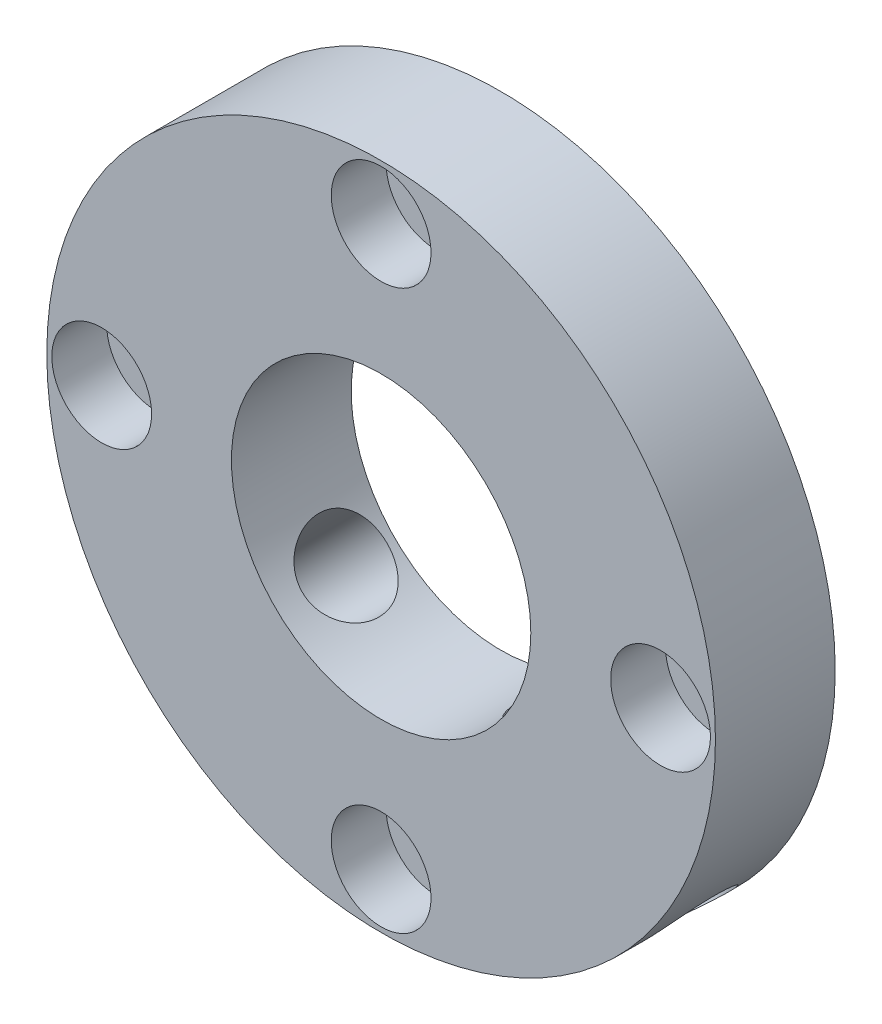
ISO-10303-21;
HEADER;
FILE_DESCRIPTION(('STEP AP214'),'2;1');
FILE_NAME('part.step','',(''),(''),'','','');
FILE_SCHEMA(('AUTOMOTIVE_DESIGN { 1 0 10303 214 1 1 1 1 }'));
ENDSEC;
DATA;
#1=APPLICATION_CONTEXT('core data for automotive mechanical design processes');
#2=APPLICATION_PROTOCOL_DEFINITION('international standard','automotive_design',2000,#1);
#3=PRODUCT_CONTEXT('',#1,'mechanical');
#4=PRODUCT('Part','Part','',(#3));
#5=PRODUCT_RELATED_PRODUCT_CATEGORY('part','',(#4));
#6=PRODUCT_DEFINITION_FORMATION('','',#4);
#7=PRODUCT_DEFINITION_CONTEXT('part definition',#1,'design');
#8=PRODUCT_DEFINITION('design','',#6,#7);
#9=PRODUCT_DEFINITION_SHAPE('','',#8);
#10=(LENGTH_UNIT() NAMED_UNIT(*) SI_UNIT(.MILLI.,.METRE.));
#11=(NAMED_UNIT(*) PLANE_ANGLE_UNIT() SI_UNIT($,.RADIAN.));
#12=(NAMED_UNIT(*) SI_UNIT($,.STERADIAN.) SOLID_ANGLE_UNIT());
#13=UNCERTAINTY_MEASURE_WITH_UNIT(LENGTH_MEASURE(1.E-05),#10,'distance_accuracy_value','');
#14=(GEOMETRIC_REPRESENTATION_CONTEXT(3) GLOBAL_UNCERTAINTY_ASSIGNED_CONTEXT((#13)) GLOBAL_UNIT_ASSIGNED_CONTEXT((#10,
#11,#12)) REPRESENTATION_CONTEXT('',''));
#15=CARTESIAN_POINT('',(0.,0.,0.));
#16=DIRECTION('',(0.,0.,1.));
#17=DIRECTION('',(1.,0.,0.));
#18=AXIS2_PLACEMENT_3D('',#15,#16,#17);
#19=CARTESIAN_POINT('',(0.,0.,12.));
#20=DIRECTION('',(0.,0.,1.));
#21=DIRECTION('',(1.,0.,0.));
#22=AXIS2_PLACEMENT_3D('',#19,#20,#21);
#23=PLANE('',#22);
#24=CARTESIAN_POINT('',(-28.,2.91935493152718E-13,12.));
#25=DIRECTION('',(0.,0.,1.));
#26=DIRECTION('',(1.,0.,0.));
#27=AXIS2_PLACEMENT_3D('',#24,#25,#26);
#28=CIRCLE('',#27,5.);
#29=CARTESIAN_POINT('',(-23.,2.91935493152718E-13,12.));
#30=VERTEX_POINT('',#29);
#31=EDGE_CURVE('E124',#30,#30,#28,.T.);
#32=ORIENTED_EDGE('',*,*,#31,.F.);
#33=EDGE_LOOP('',(#32));
#34=FACE_BOUND('',#33,.T.);
#35=CARTESIAN_POINT('',(0.,-28.,12.));
#36=DIRECTION('',(0.,0.,1.));
#37=DIRECTION('',(1.,0.,0.));
#38=AXIS2_PLACEMENT_3D('',#35,#36,#37);
#39=CIRCLE('',#38,5.);
#40=CARTESIAN_POINT('',(5.,-28.,12.));
#41=VERTEX_POINT('',#40);
#42=EDGE_CURVE('E108',#41,#41,#39,.T.);
#43=ORIENTED_EDGE('',*,*,#42,.F.);
#44=EDGE_LOOP('',(#43));
#45=FACE_BOUND('',#44,.T.);
#46=CARTESIAN_POINT('',(28.,0.,12.));
#47=DIRECTION('',(0.,0.,1.));
#48=DIRECTION('',(1.,0.,0.));
#49=AXIS2_PLACEMENT_3D('',#46,#47,#48);
#50=CIRCLE('',#49,5.);
#51=CARTESIAN_POINT('',(33.,0.,12.));
#52=VERTEX_POINT('',#51);
#53=EDGE_CURVE('E92',#52,#52,#50,.T.);
#54=ORIENTED_EDGE('',*,*,#53,.F.);
#55=EDGE_LOOP('',(#54));
#56=FACE_BOUND('',#55,.T.);
#57=CARTESIAN_POINT('',(0.,28.,12.));
#58=DIRECTION('',(0.,0.,1.));
#59=DIRECTION('',(1.,0.,0.));
#60=AXIS2_PLACEMENT_3D('',#57,#58,#59);
#61=CIRCLE('',#60,5.);
#62=CARTESIAN_POINT('',(5.,28.,12.));
#63=VERTEX_POINT('',#62);
#64=EDGE_CURVE('E76',#63,#63,#61,.T.);
#65=ORIENTED_EDGE('',*,*,#64,.F.);
#66=EDGE_LOOP('',(#65));
#67=FACE_BOUND('',#66,.T.);
#68=CARTESIAN_POINT('',(0.,0.,12.));
#69=DIRECTION('',(0.,0.,1.));
#70=DIRECTION('',(1.,0.,0.));
#71=AXIS2_PLACEMENT_3D('',#68,#69,#70);
#72=CIRCLE('',#71,33.5);
#73=CARTESIAN_POINT('',(33.5,0.,12.));
#74=VERTEX_POINT('',#73);
#75=EDGE_CURVE('E10',#74,#74,#72,.T.);
#76=ORIENTED_EDGE('',*,*,#75,.T.);
#77=EDGE_LOOP('',(#76));
#78=FACE_BOUND('',#77,.T.);
#79=CARTESIAN_POINT('',(0.,0.,12.));
#80=DIRECTION('',(0.,0.,1.));
#81=DIRECTION('',(1.,0.,0.));
#82=AXIS2_PLACEMENT_3D('',#79,#80,#81);
#83=CIRCLE('',#82,15.);
#84=CARTESIAN_POINT('',(15.,0.,12.));
#85=VERTEX_POINT('',#84);
#86=EDGE_CURVE('E55',#85,#85,#83,.T.);
#87=ORIENTED_EDGE('',*,*,#86,.F.);
#88=EDGE_LOOP('',(#87));
#89=FACE_BOUND('',#88,.T.);
#90=ADVANCED_FACE('F41',(#34,#45,#56,#67,#78,#89),#23,.T.);
#91=CARTESIAN_POINT('',(0.,0.,0.));
#92=DIRECTION('',(0.,0.,1.));
#93=DIRECTION('',(1.,0.,0.));
#94=AXIS2_PLACEMENT_3D('',#91,#92,#93);
#95=PLANE('',#94);
#96=CARTESIAN_POINT('',(-28.,2.91935493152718E-13,0.));
#97=DIRECTION('',(0.,0.,1.));
#98=DIRECTION('',(1.,0.,0.));
#99=AXIS2_PLACEMENT_3D('',#96,#97,#98);
#100=CIRCLE('',#99,2.75);
#101=CARTESIAN_POINT('',(-25.25,2.91935493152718E-13,0.));
#102=VERTEX_POINT('',#101);
#103=EDGE_CURVE('E112',#102,#102,#100,.T.);
#104=ORIENTED_EDGE('',*,*,#103,.T.);
#105=EDGE_LOOP('',(#104));
#106=FACE_BOUND('',#105,.T.);
#107=CARTESIAN_POINT('',(0.,-28.,0.));
#108=DIRECTION('',(0.,0.,1.));
#109=DIRECTION('',(1.,0.,0.));
#110=AXIS2_PLACEMENT_3D('',#107,#108,#109);
#111=CIRCLE('',#110,2.75);
#112=CARTESIAN_POINT('',(2.75,-28.,0.));
#113=VERTEX_POINT('',#112);
#114=EDGE_CURVE('E96',#113,#113,#111,.T.);
#115=ORIENTED_EDGE('',*,*,#114,.T.);
#116=EDGE_LOOP('',(#115));
#117=FACE_BOUND('',#116,.T.);
#118=CARTESIAN_POINT('',(28.,0.,0.));
#119=DIRECTION('',(0.,0.,1.));
#120=DIRECTION('',(1.,0.,0.));
#121=AXIS2_PLACEMENT_3D('',#118,#119,#120);
#122=CIRCLE('',#121,2.75);
#123=CARTESIAN_POINT('',(30.75,0.,0.));
#124=VERTEX_POINT('',#123);
#125=EDGE_CURVE('E80',#124,#124,#122,.T.);
#126=ORIENTED_EDGE('',*,*,#125,.T.);
#127=EDGE_LOOP('',(#126));
#128=FACE_BOUND('',#127,.T.);
#129=CARTESIAN_POINT('',(0.,28.,0.));
#130=DIRECTION('',(0.,0.,1.));
#131=DIRECTION('',(1.,0.,0.));
#132=AXIS2_PLACEMENT_3D('',#129,#130,#131);
#133=CIRCLE('',#132,2.75);
#134=CARTESIAN_POINT('',(2.75,28.,0.));
#135=VERTEX_POINT('',#134);
#136=EDGE_CURVE('E61',#135,#135,#133,.T.);
#137=ORIENTED_EDGE('',*,*,#136,.T.);
#138=EDGE_LOOP('',(#137));
#139=FACE_BOUND('',#138,.T.);
#140=CARTESIAN_POINT('',(0.,0.,0.));
#141=DIRECTION('',(0.,0.,1.));
#142=DIRECTION('',(1.,0.,0.));
#143=AXIS2_PLACEMENT_3D('',#140,#141,#142);
#144=CIRCLE('',#143,33.5);
#145=CARTESIAN_POINT('',(33.5,0.,0.));
#146=VERTEX_POINT('',#145);
#147=EDGE_CURVE('E46',#146,#146,#144,.T.);
#148=ORIENTED_EDGE('',*,*,#147,.F.);
#149=EDGE_LOOP('',(#148));
#150=FACE_BOUND('',#149,.T.);
#151=CARTESIAN_POINT('',(0.,0.,0.));
#152=DIRECTION('',(0.,0.,1.));
#153=DIRECTION('',(1.,0.,0.));
#154=AXIS2_PLACEMENT_3D('',#151,#152,#153);
#155=CIRCLE('',#154,15.);
#156=CARTESIAN_POINT('',(15.,0.,0.));
#157=VERTEX_POINT('',#156);
#158=EDGE_CURVE('E57',#157,#157,#155,.T.);
#159=ORIENTED_EDGE('',*,*,#158,.T.);
#160=EDGE_LOOP('',(#159));
#161=FACE_BOUND('',#160,.T.);
#162=ADVANCED_FACE('F206',(#106,#117,#128,#139,#150,#161),#95,.F.);
#163=CARTESIAN_POINT('',(0.,0.,12.));
#164=DIRECTION('',(0.,0.,-1.));
#165=DIRECTION('',(-1.,0.,0.));
#166=AXIS2_PLACEMENT_3D('',#163,#164,#165);
#167=CYLINDRICAL_SURFACE('',#166,33.5);
#168=CARTESIAN_POINT('',(26.5018791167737,-20.4914714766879,5.05));
#169=CARTESIAN_POINT('',(26.5018744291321,-20.4914810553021,4.81230853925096));
#170=CARTESIAN_POINT('',(26.4895545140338,-20.5074417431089,4.57446924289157));
#171=CARTESIAN_POINT('',(26.4404524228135,-20.5707077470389,4.10541184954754));
#172=CARTESIAN_POINT('',(26.4036448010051,-20.6180456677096,3.87420090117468));
#173=CARTESIAN_POINT('',(26.3062231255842,-20.7421988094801,3.42525918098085));
#174=CARTESIAN_POINT('',(26.2456253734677,-20.818993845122,3.20751929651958));
#175=CARTESIAN_POINT('',(26.1016979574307,-20.9991570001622,2.79147309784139));
#176=CARTESIAN_POINT('',(26.0183721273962,-21.1025206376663,2.59316351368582));
#177=CARTESIAN_POINT('',(25.8299981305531,-21.3326829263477,2.22042486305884));
#178=CARTESIAN_POINT('',(25.7248403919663,-21.4595994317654,2.04612393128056));
#179=CARTESIAN_POINT('',(25.4950782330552,-21.7320656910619,1.72745742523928));
#180=CARTESIAN_POINT('',(25.3704728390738,-21.8776163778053,1.58309335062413));
#181=CARTESIAN_POINT('',(25.1039419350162,-22.1829493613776,1.32793795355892));
#182=CARTESIAN_POINT('',(24.9619588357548,-22.34277847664,1.2172627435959));
#183=CARTESIAN_POINT('',(24.6642645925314,-22.6709744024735,1.03337054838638));
#184=CARTESIAN_POINT('',(24.5085539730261,-22.839340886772,0.96015213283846));
#185=CARTESIAN_POINT('',(24.1881893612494,-23.178342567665,0.853635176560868));
#186=CARTESIAN_POINT('',(24.0235881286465,-23.3489606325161,0.820123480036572));
#187=CARTESIAN_POINT('',(23.6891474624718,-23.6882040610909,0.793310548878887));
#188=CARTESIAN_POINT('',(23.5193082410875,-23.8568295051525,0.800007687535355));
#189=CARTESIAN_POINT('',(23.1803039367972,-24.1863409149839,0.853251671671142));
#190=CARTESIAN_POINT('',(23.0111405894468,-24.3472657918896,0.899569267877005));
#191=CARTESIAN_POINT('',(22.6776247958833,-24.6582106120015,1.03038091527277));
#192=CARTESIAN_POINT('',(22.5132724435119,-24.8082303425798,1.11487571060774));
#193=CARTESIAN_POINT('',(22.1941097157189,-25.09417421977,1.31988642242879));
#194=CARTESIAN_POINT('',(22.0393270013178,-25.2300582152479,1.44050136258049));
#195=CARTESIAN_POINT('',(21.7448557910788,-25.4842921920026,1.71425649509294));
#196=CARTESIAN_POINT('',(21.605168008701,-25.6026413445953,1.86739822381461));
#197=CARTESIAN_POINT('',(21.3447015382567,-25.8202009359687,2.20314331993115));
#198=CARTESIAN_POINT('',(21.2240628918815,-25.9192707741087,2.38594650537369));
#199=CARTESIAN_POINT('',(21.0071935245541,-26.0953519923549,2.77513950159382));
#200=CARTESIAN_POINT('',(20.910962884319,-26.172363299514,2.9815293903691));
#201=CARTESIAN_POINT('',(20.7464477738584,-26.3029655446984,3.41221602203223));
#202=CARTESIAN_POINT('',(20.6781757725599,-26.3565460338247,3.63652070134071));
#203=CARTESIAN_POINT('',(20.5722842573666,-26.4392828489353,4.09657646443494));
#204=CARTESIAN_POINT('',(20.5346632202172,-26.4684403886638,4.33232697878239));
#205=CARTESIAN_POINT('',(20.4917152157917,-26.5017047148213,4.80682878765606));
#206=CARTESIAN_POINT('',(20.4861657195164,-26.5059841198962,5.04554785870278));
#207=CARTESIAN_POINT('',(20.5069846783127,-26.4898800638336,5.52074699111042));
#208=CARTESIAN_POINT('',(20.5333524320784,-26.4694971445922,5.75722710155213));
#209=CARTESIAN_POINT('',(20.6168159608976,-26.4045384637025,6.22039623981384));
#210=CARTESIAN_POINT('',(20.6738044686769,-26.3600471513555,6.44711648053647));
#211=CARTESIAN_POINT('',(20.8162571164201,-26.2476974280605,6.88530713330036));
#212=CARTESIAN_POINT('',(20.9017222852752,-26.1798381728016,7.09677699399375));
#213=CARTESIAN_POINT('',(21.0985049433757,-26.0215115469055,7.49972738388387));
#214=CARTESIAN_POINT('',(21.2099604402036,-25.9309232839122,7.69109300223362));
#215=CARTESIAN_POINT('',(21.4544709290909,-25.7289866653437,8.04722967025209));
#216=CARTESIAN_POINT('',(21.5875267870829,-25.6176374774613,8.21199965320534));
#217=CARTESIAN_POINT('',(21.8714865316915,-25.375638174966,8.51125086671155));
#218=CARTESIAN_POINT('',(22.0224907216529,-25.2448784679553,8.64554838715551));
#219=CARTESIAN_POINT('',(22.3366281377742,-24.9673568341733,8.878770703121));
#220=CARTESIAN_POINT('',(22.4997611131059,-24.8205952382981,8.97769622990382));
#221=CARTESIAN_POINT('',(22.832384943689,-24.5149551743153,9.13706373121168));
#222=CARTESIAN_POINT('',(23.0018569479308,-24.3561113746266,9.19761148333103));
#223=CARTESIAN_POINT('',(23.3422861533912,-24.0300478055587,9.2788486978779));
#224=CARTESIAN_POINT('',(23.513243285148,-23.8628284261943,9.299540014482));
#225=CARTESIAN_POINT('',(23.8503637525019,-23.5258699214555,9.30044163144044));
#226=CARTESIAN_POINT('',(24.0165523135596,-23.3561567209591,9.28093505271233));
#227=CARTESIAN_POINT('',(24.3407957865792,-23.0180482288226,9.20259473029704));
#228=CARTESIAN_POINT('',(24.4988507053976,-22.8496529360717,9.1437610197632));
#229=CARTESIAN_POINT('',(24.8027436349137,-22.5194201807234,8.98852622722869));
#230=CARTESIAN_POINT('',(24.9485861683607,-22.3575803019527,8.8921391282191));
#231=CARTESIAN_POINT('',(25.2247377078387,-22.0455453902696,8.66456298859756));
#232=CARTESIAN_POINT('',(25.3550465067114,-21.8953505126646,8.53337348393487));
#233=CARTESIAN_POINT('',(25.5981977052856,-21.6105905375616,8.23887054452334));
#234=CARTESIAN_POINT('',(25.7109164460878,-21.4761376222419,8.07534652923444));
#235=CARTESIAN_POINT('',(25.9156265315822,-21.2286637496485,7.72125450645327));
#236=CARTESIAN_POINT('',(26.0076129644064,-21.1156478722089,7.53068010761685));
#237=CARTESIAN_POINT('',(26.1694447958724,-20.9147535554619,7.12702585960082));
#238=CARTESIAN_POINT('',(26.2392006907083,-20.8269768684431,6.91385952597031));
#239=CARTESIAN_POINT('',(26.3547595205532,-20.680556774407,6.47180222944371));
#240=CARTESIAN_POINT('',(26.4005884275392,-20.6218817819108,6.24292862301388));
#241=CARTESIAN_POINT('',(26.4566263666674,-20.5498953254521,5.85240054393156));
#242=CARTESIAN_POINT('',(26.4735804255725,-20.5280268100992,5.69320617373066));
#243=CARTESIAN_POINT('',(26.4962083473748,-20.4988116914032,5.37269724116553));
#244=CARTESIAN_POINT('',(26.5018822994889,-20.4914649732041,5.21138269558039));
#245=CARTESIAN_POINT('',(26.5018791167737,-20.4914714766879,5.05));
#246=B_SPLINE_CURVE_WITH_KNOTS('',3,(#168,#169,#170,#171,#172,#173,#174,#175,#176,#177,#178,
#179,#180,#181,#182,#183,#184,#185,#186,#187,#188,#189,#190,#191,#192,#193,#194,#195,#196,#197,
#198,#199,#200,#201,#202,#203,#204,#205,#206,#207,#208,#209,#210,#211,#212,#213,#214,#215,#216,
#217,#218,#219,#220,#221,#222,#223,#224,#225,#226,#227,#228,#229,#230,#231,#232,#233,#234,#235,
#236,#237,#238,#239,#240,#241,#242,#243,#244,#245),.UNSPECIFIED.,.T.,.F.,(4,2,2,2,2,2,2,2,2,2,2,
2,2,2,2,2,2,2,2,2,2,2,2,2,2,2,2,2,2,2,2,2,2,2,2,2,2,2,4),(0.,0.712484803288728,1.42571112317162,
2.13844957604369,2.85106787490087,3.56735314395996,4.28367428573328,5.00243706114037,
5.72117238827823,6.43603162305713,7.15086193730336,7.86158391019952,8.5723197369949,
9.28502217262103,9.99775827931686,10.7155119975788,11.4332680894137,12.1513439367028,
12.869384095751,13.5824360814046,14.295472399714,15.00602701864,15.7166073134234,
16.4310503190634,17.145521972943,17.8641928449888,18.5828488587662,19.2995153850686,
20.0161485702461,20.7277516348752,21.4393540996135,22.1506918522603,22.8620390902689,
23.5781813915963,24.2944931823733,25.013653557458,25.7320316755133,26.2157832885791,
26.6995310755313),.UNSPECIFIED.);
#247=CARTESIAN_POINT('',(26.5018791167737,-20.4914714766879,5.05));
#248=VERTEX_POINT('',#247);
#249=EDGE_CURVE('E262',#248,#248,#246,.T.);
#250=ORIENTED_EDGE('',*,*,#249,.T.);
#251=EDGE_LOOP('',(#250));
#252=FACE_BOUND('',#251,.T.);
#253=CARTESIAN_POINT('',(-20.491471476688,-26.5018791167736,5.05));
#254=CARTESIAN_POINT('',(-20.4914810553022,-26.501874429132,4.81230853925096));
#255=CARTESIAN_POINT('',(-20.507441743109,-26.4895545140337,4.57446924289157));
#256=CARTESIAN_POINT('',(-20.570707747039,-26.4404524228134,4.10541184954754));
#257=CARTESIAN_POINT('',(-20.6180456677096,-26.403644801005,3.87420090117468));
#258=CARTESIAN_POINT('',(-20.7421988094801,-26.3062231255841,3.42525918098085));
#259=CARTESIAN_POINT('',(-20.8189938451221,-26.2456253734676,3.20751929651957));
#260=CARTESIAN_POINT('',(-20.9991570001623,-26.1016979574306,2.79147309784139));
#261=CARTESIAN_POINT('',(-21.1025206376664,-26.0183721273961,2.59316351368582));
#262=CARTESIAN_POINT('',(-21.3326829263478,-25.8299981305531,2.22042486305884));
#263=CARTESIAN_POINT('',(-21.4595994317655,-25.7248403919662,2.04612393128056));
#264=CARTESIAN_POINT('',(-21.732065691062,-25.4950782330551,1.72745742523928));
#265=CARTESIAN_POINT('',(-21.8776163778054,-25.3704728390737,1.58309335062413));
#266=CARTESIAN_POINT('',(-22.1829493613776,-25.1039419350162,1.32793795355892));
#267=CARTESIAN_POINT('',(-22.3427784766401,-24.9619588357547,1.2172627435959));
#268=CARTESIAN_POINT('',(-22.6709744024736,-24.6642645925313,1.03337054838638));
#269=CARTESIAN_POINT('',(-22.8393408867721,-24.508553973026,0.96015213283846));
#270=CARTESIAN_POINT('',(-23.178342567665,-24.1881893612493,0.853635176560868));
#271=CARTESIAN_POINT('',(-23.3489606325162,-24.0235881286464,0.820123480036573));
#272=CARTESIAN_POINT('',(-23.688204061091,-23.6891474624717,0.793310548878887));
#273=CARTESIAN_POINT('',(-23.8568295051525,-23.5193082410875,0.800007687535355));
#274=CARTESIAN_POINT('',(-24.186340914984,-23.1803039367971,0.853251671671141));
#275=CARTESIAN_POINT('',(-24.3472657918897,-23.0111405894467,0.899569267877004));
#276=CARTESIAN_POINT('',(-24.6582106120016,-22.6776247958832,1.03038091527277));
#277=CARTESIAN_POINT('',(-24.8082303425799,-22.5132724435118,1.11487571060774));
#278=CARTESIAN_POINT('',(-25.0941742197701,-22.1941097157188,1.31988642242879));
#279=CARTESIAN_POINT('',(-25.230058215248,-22.0393270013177,1.44050136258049));
#280=CARTESIAN_POINT('',(-25.4842921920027,-21.7448557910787,1.71425649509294));
#281=CARTESIAN_POINT('',(-25.6026413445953,-21.6051680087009,1.86739822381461));
#282=CARTESIAN_POINT('',(-25.8202009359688,-21.3447015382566,2.20314331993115));
#283=CARTESIAN_POINT('',(-25.9192707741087,-21.2240628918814,2.38594650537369));
#284=CARTESIAN_POINT('',(-26.095351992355,-21.007193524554,2.77513950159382));
#285=CARTESIAN_POINT('',(-26.172363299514,-20.9109628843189,2.9815293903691));
#286=CARTESIAN_POINT('',(-26.3029655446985,-20.7464477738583,3.41221602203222));
#287=CARTESIAN_POINT('',(-26.3565460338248,-20.6781757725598,3.63652070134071));
#288=CARTESIAN_POINT('',(-26.4392828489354,-20.5722842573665,4.09657646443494));
#289=CARTESIAN_POINT('',(-26.4684403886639,-20.5346632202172,4.33232697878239));
#290=CARTESIAN_POINT('',(-26.5017047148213,-20.4917152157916,4.80682878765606));
#291=CARTESIAN_POINT('',(-26.5059841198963,-20.4861657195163,5.04554785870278));
#292=CARTESIAN_POINT('',(-26.4898800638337,-20.5069846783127,5.52074699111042));
#293=CARTESIAN_POINT('',(-26.4694971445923,-20.5333524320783,5.75722710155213));
#294=CARTESIAN_POINT('',(-26.4045384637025,-20.6168159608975,6.22039623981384));
#295=CARTESIAN_POINT('',(-26.3600471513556,-20.6738044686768,6.44711648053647));
#296=CARTESIAN_POINT('',(-26.2476974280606,-20.8162571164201,6.88530713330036));
#297=CARTESIAN_POINT('',(-26.1798381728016,-20.9017222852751,7.09677699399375));
#298=CARTESIAN_POINT('',(-26.0215115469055,-21.0985049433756,7.49972738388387));
#299=CARTESIAN_POINT('',(-25.9309232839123,-21.2099604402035,7.69109300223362));
#300=CARTESIAN_POINT('',(-25.7289866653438,-21.4544709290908,8.04722967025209));
#301=CARTESIAN_POINT('',(-25.6176374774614,-21.5875267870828,8.21199965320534));
#302=CARTESIAN_POINT('',(-25.375638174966,-21.8714865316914,8.51125086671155));
#303=CARTESIAN_POINT('',(-25.2448784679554,-22.0224907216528,8.64554838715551));
#304=CARTESIAN_POINT('',(-24.9673568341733,-22.3366281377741,8.878770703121));
#305=CARTESIAN_POINT('',(-24.8205952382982,-22.4997611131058,8.97769622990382));
#306=CARTESIAN_POINT('',(-24.5149551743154,-22.832384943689,9.13706373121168));
#307=CARTESIAN_POINT('',(-24.3561113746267,-23.0018569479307,9.19761148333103));
#308=CARTESIAN_POINT('',(-24.0300478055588,-23.3422861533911,9.2788486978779));
#309=CARTESIAN_POINT('',(-23.8628284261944,-23.5132432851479,9.299540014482));
#310=CARTESIAN_POINT('',(-23.5258699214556,-23.8503637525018,9.30044163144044));
#311=CARTESIAN_POINT('',(-23.3561567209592,-24.0165523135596,9.28093505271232));
#312=CARTESIAN_POINT('',(-23.0180482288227,-24.3407957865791,9.20259473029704));
#313=CARTESIAN_POINT('',(-22.8496529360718,-24.4988507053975,9.1437610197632));
#314=CARTESIAN_POINT('',(-22.5194201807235,-24.8027436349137,8.98852622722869));
#315=CARTESIAN_POINT('',(-22.3575803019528,-24.9485861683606,8.8921391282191));
#316=CARTESIAN_POINT('',(-22.0455453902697,-25.2247377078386,8.66456298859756));
#317=CARTESIAN_POINT('',(-21.8953505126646,-25.3550465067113,8.53337348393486));
#318=CARTESIAN_POINT('',(-21.6105905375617,-25.5981977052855,8.23887054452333));
#319=CARTESIAN_POINT('',(-21.476137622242,-25.7109164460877,8.07534652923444));
#320=CARTESIAN_POINT('',(-21.2286637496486,-25.9156265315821,7.72125450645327));
#321=CARTESIAN_POINT('',(-21.1156478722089,-26.0076129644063,7.53068010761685));
#322=CARTESIAN_POINT('',(-20.914753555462,-26.1694447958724,7.12702585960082));
#323=CARTESIAN_POINT('',(-20.8269768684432,-26.2392006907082,6.91385952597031));
#324=CARTESIAN_POINT('',(-20.6805567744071,-26.3547595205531,6.47180222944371));
#325=CARTESIAN_POINT('',(-20.6218817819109,-26.4005884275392,6.24292862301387));
#326=CARTESIAN_POINT('',(-20.5498953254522,-26.4566263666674,5.85240054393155));
#327=CARTESIAN_POINT('',(-20.5280268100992,-26.4735804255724,5.69320617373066));
#328=CARTESIAN_POINT('',(-20.4988116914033,-26.4962083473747,5.37269724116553));
#329=CARTESIAN_POINT('',(-20.4914649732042,-26.5018822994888,5.21138269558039));
#330=CARTESIAN_POINT('',(-20.491471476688,-26.5018791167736,5.05));
#331=B_SPLINE_CURVE_WITH_KNOTS('',3,(#253,#254,#255,#256,#257,#258,#259,#260,#261,#262,#263,
#264,#265,#266,#267,#268,#269,#270,#271,#272,#273,#274,#275,#276,#277,#278,#279,#280,#281,#282,
#283,#284,#285,#286,#287,#288,#289,#290,#291,#292,#293,#294,#295,#296,#297,#298,#299,#300,#301,
#302,#303,#304,#305,#306,#307,#308,#309,#310,#311,#312,#313,#314,#315,#316,#317,#318,#319,#320,
#321,#322,#323,#324,#325,#326,#327,#328,#329,#330),.UNSPECIFIED.,.T.,.F.,(4,2,2,2,2,2,2,2,2,2,2,
2,2,2,2,2,2,2,2,2,2,2,2,2,2,2,2,2,2,2,2,2,2,2,2,2,2,2,4),(0.,0.712484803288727,1.42571112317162,
2.13844957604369,2.85106787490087,3.56735314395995,4.28367428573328,5.00243706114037,
5.72117238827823,6.43603162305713,7.15086193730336,7.86158391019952,8.5723197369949,
9.28502217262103,9.99775827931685,10.7155119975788,11.4332680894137,12.1513439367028,
12.869384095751,13.5824360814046,14.295472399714,15.00602701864,15.7166073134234,
16.4310503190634,17.145521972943,17.8641928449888,18.5828488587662,19.2995153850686,
20.0161485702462,20.7277516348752,21.4393540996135,22.1506918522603,22.8620390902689,
23.5781813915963,24.2944931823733,25.013653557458,25.7320316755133,26.2157832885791,
26.6995310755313),.UNSPECIFIED.);
#332=CARTESIAN_POINT('',(-20.491471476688,-26.5018791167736,5.05));
#333=VERTEX_POINT('',#332);
#334=EDGE_CURVE('E128',#333,#333,#331,.T.);
#335=ORIENTED_EDGE('',*,*,#334,.T.);
#336=EDGE_LOOP('',(#335));
#337=FACE_BOUND('',#336,.T.);
#338=ORIENTED_EDGE('',*,*,#75,.F.);
#339=EDGE_LOOP('',(#338));
#340=FACE_BOUND('',#339,.T.);
#341=ORIENTED_EDGE('',*,*,#147,.T.);
#342=EDGE_LOOP('',(#341));
#343=FACE_BOUND('',#342,.T.);
#344=ADVANCED_FACE('F43',(#252,#337,#340,#343),#167,.T.);
#345=CARTESIAN_POINT('',(0.,0.,12.));
#346=DIRECTION('',(0.,0.,-1.));
#347=DIRECTION('',(-1.,0.,0.));
#348=AXIS2_PLACEMENT_3D('',#345,#346,#347);
#349=CYLINDRICAL_SURFACE('',#348,15.);
#350=CARTESIAN_POINT('',(13.1771628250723,-7.16675518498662,5.05));
#351=CARTESIAN_POINT('',(13.177162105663,-7.16676069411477,4.81647657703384));
#352=CARTESIAN_POINT('',(13.1675716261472,-7.18447604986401,4.58290840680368));
#353=CARTESIAN_POINT('',(13.1291964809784,-7.25436002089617,4.1225579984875));
#354=CARTESIAN_POINT('',(13.1004037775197,-7.30654306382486,3.89577864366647));
#355=CARTESIAN_POINT('',(13.0236565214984,-7.44247295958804,3.45573377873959));
#356=CARTESIAN_POINT('',(12.9757312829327,-7.52617151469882,3.24244817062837));
#357=CARTESIAN_POINT('',(12.8606839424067,-7.7211117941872,2.83447556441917));
#358=CARTESIAN_POINT('',(12.7935596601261,-7.83235664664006,2.63979068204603));
#359=CARTESIAN_POINT('',(12.6381645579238,-8.08076417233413,2.26905055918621));
#360=CARTESIAN_POINT('',(12.5493974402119,-8.21851622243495,2.09359811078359));
#361=CARTESIAN_POINT('',(12.3519378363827,-8.51239832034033,1.77165149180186));
#362=CARTESIAN_POINT('',(12.2432430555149,-8.66853048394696,1.62516066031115));
#363=CARTESIAN_POINT('',(12.0045453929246,-8.99625840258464,1.36273160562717));
#364=CARTESIAN_POINT('',(11.8741896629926,-9.16808446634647,1.24740012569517));
#365=CARTESIAN_POINT('',(11.5954278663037,-9.51819534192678,1.0545334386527));
#366=CARTESIAN_POINT('',(11.4470252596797,-9.69647891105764,0.97699100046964));
#367=CARTESIAN_POINT('',(11.1392480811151,-10.0484012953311,0.863875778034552));
#368=CARTESIAN_POINT('',(10.9802533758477,-10.2220417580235,0.82727585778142));
#369=CARTESIAN_POINT('',(10.6521681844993,-10.5634901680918,0.793845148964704));
#370=CARTESIAN_POINT('',(10.4830796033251,-10.7312992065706,0.797006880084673));
#371=CARTESIAN_POINT('',(10.1448724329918,-11.0514379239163,0.842302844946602));
#372=CARTESIAN_POINT('',(9.97589146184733,-11.20407210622,0.883326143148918));
#373=CARTESIAN_POINT('',(9.63860928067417,-11.4955173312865,1.00137630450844));
#374=CARTESIAN_POINT('',(9.4703081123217,-11.6343275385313,1.07840534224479));
#375=CARTESIAN_POINT('',(9.13814631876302,-11.8970436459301,1.2670829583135));
#376=CARTESIAN_POINT('',(8.97435337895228,-12.0207721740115,1.37909683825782));
#377=CARTESIAN_POINT('',(8.65874983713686,-12.2500677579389,1.63428015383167));
#378=CARTESIAN_POINT('',(8.50694183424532,-12.355630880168,1.77745632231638));
#379=CARTESIAN_POINT('',(8.21581973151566,-12.5511811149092,2.09673271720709));
#380=CARTESIAN_POINT('',(8.07711809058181,-12.6405044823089,2.27379914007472));
#381=CARTESIAN_POINT('',(7.82411314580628,-12.7986551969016,2.65281120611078));
#382=CARTESIAN_POINT('',(7.70981175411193,-12.8674809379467,2.85475879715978));
#383=CARTESIAN_POINT('',(7.51009668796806,-12.9850699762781,3.27995935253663));
#384=CARTESIAN_POINT('',(7.42491335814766,-13.0336739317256,3.50336506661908));
#385=CARTESIAN_POINT('',(7.28918737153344,-13.1100679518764,3.96383194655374));
#386=CARTESIAN_POINT('',(7.23863483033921,-13.137863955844,4.20088919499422));
#387=CARTESIAN_POINT('',(7.17614197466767,-13.1721001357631,4.6734169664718));
#388=CARTESIAN_POINT('',(7.16296460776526,-13.1792246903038,4.90867449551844));
#389=CARTESIAN_POINT('',(7.17242835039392,-13.1740769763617,5.37823494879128));
#390=CARTESIAN_POINT('',(7.19506507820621,-13.1618070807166,5.61253798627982));
#391=CARTESIAN_POINT('',(7.27395711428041,-13.1183641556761,6.06809657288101));
#392=CARTESIAN_POINT('',(7.32944762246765,-13.0876209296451,6.28952685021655));
#393=CARTESIAN_POINT('',(7.47057890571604,-13.0075743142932,6.71900918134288));
#394=CARTESIAN_POINT('',(7.55622397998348,-12.9582682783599,6.92705932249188));
#395=CARTESIAN_POINT('',(7.75614113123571,-12.8396285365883,7.32948293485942));
#396=CARTESIAN_POINT('',(7.87106059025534,-12.7698356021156,7.52339895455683));
#397=CARTESIAN_POINT('',(8.12347910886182,-12.6107613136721,7.88705912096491));
#398=CARTESIAN_POINT('',(8.26098297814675,-12.5214758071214,8.0567981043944));
#399=CARTESIAN_POINT('',(8.55808153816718,-12.3204061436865,8.3730722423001));
#400=CARTESIAN_POINT('',(8.71825726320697,-12.2079744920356,8.51865211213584));
#401=CARTESIAN_POINT('',(9.05079697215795,-11.9635110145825,8.77540355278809));
#402=CARTESIAN_POINT('',(9.2231603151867,-11.8314802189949,8.88657693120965));
#403=CARTESIAN_POINT('',(9.57229587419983,-11.5507957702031,9.07030195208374));
#404=CARTESIAN_POINT('',(9.74902363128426,-11.4022787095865,9.14314591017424));
#405=CARTESIAN_POINT('',(10.101799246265,-11.0909387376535,9.24895126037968));
#406=CARTESIAN_POINT('',(10.2778472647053,-10.9281194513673,9.28192272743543));
#407=CARTESIAN_POINT('',(10.6173302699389,-10.5984135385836,9.30634936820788));
#408=CARTESIAN_POINT('',(10.780990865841,-10.4318610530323,9.29919766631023));
#409=CARTESIAN_POINT('',(11.0974821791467,-10.0945223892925,9.24686217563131));
#410=CARTESIAN_POINT('',(11.2503133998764,-9.92373640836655,9.20168015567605));
#411=CARTESIAN_POINT('',(11.5402836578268,-9.58494598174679,9.07539277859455));
#412=CARTESIAN_POINT('',(11.6775471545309,-9.41693025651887,8.99460198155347));
#413=CARTESIAN_POINT('',(11.9355500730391,-9.08770806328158,8.79967016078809));
#414=CARTESIAN_POINT('',(12.0562869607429,-8.92650264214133,8.68552403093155));
#415=CARTESIAN_POINT('',(12.2831331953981,-8.61181712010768,8.42322491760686));
#416=CARTESIAN_POINT('',(12.3887090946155,-8.45870272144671,8.27417200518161));
#417=CARTESIAN_POINT('',(12.5802013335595,-8.17119541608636,7.94795483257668));
#418=CARTESIAN_POINT('',(12.6661122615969,-8.0368076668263,7.77078285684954));
#419=CARTESIAN_POINT('',(12.8199909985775,-7.78907483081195,7.38788332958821));
#420=CARTESIAN_POINT('',(12.8874408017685,-7.67635945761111,7.18153881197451));
#421=CARTESIAN_POINT('',(13.0013611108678,-7.4818045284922,6.7494799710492));
#422=CARTESIAN_POINT('',(13.0478436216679,-7.39994730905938,6.52377681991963));
#423=CARTESIAN_POINT('',(13.1149834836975,-7.28019517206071,6.09119156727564));
#424=CARTESIAN_POINT('',(13.1383010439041,-7.23782269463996,5.88594949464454));
#425=CARTESIAN_POINT('',(13.1693898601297,-7.18110234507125,5.47048319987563));
#426=CARTESIAN_POINT('',(13.1771634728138,-7.16675022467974,5.26025973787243));
#427=CARTESIAN_POINT('',(13.1771628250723,-7.16675518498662,5.05));
#428=B_SPLINE_CURVE_WITH_KNOTS('',3,(#350,#351,#352,#353,#354,#355,#356,#357,#358,#359,#360,
#361,#362,#363,#364,#365,#366,#367,#368,#369,#370,#371,#372,#373,#374,#375,#376,#377,#378,#379,
#380,#381,#382,#383,#384,#385,#386,#387,#388,#389,#390,#391,#392,#393,#394,#395,#396,#397,#398,
#399,#400,#401,#402,#403,#404,#405,#406,#407,#408,#409,#410,#411,#412,#413,#414,#415,#416,#417,
#418,#419,#420,#421,#422,#423,#424,#425,#426,#427),.UNSPECIFIED.,.T.,.F.,(4,2,2,2,2,2,2,2,2,2,2,
2,2,2,2,2,2,2,2,2,2,2,2,2,2,2,2,2,2,2,2,2,2,2,2,2,2,2,4),(0.,0.699795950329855,1.39988501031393,
2.09890551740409,2.79800543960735,3.51496036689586,4.23199790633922,4.9621287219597,
5.69211976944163,6.40335519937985,7.11445682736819,7.80533472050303,8.49625434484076,
9.19464418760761,9.89318507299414,10.6158478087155,11.3385671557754,12.0668781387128,
12.7949811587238,13.498687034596,14.2023068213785,14.89015768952,15.5781066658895,
16.2828380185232,16.9877196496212,17.715958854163,18.4441597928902,19.1667235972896,
19.8891047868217,20.5865627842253,21.2839883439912,21.9753727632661,22.6668630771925,
23.3786525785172,24.0906377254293,24.8209248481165,25.5507933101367,26.180970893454,
26.8110529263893),.UNSPECIFIED.);
#429=CARTESIAN_POINT('',(13.1771628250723,-7.16675518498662,5.05));
#430=VERTEX_POINT('',#429);
#431=EDGE_CURVE('E268',#430,#430,#428,.T.);
#432=ORIENTED_EDGE('',*,*,#431,.F.);
#433=EDGE_LOOP('',(#432));
#434=FACE_BOUND('',#433,.T.);
#435=CARTESIAN_POINT('',(-7.16675518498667,-13.1771628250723,5.05));
#436=CARTESIAN_POINT('',(-7.16676069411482,-13.177162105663,4.81647657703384));
#437=CARTESIAN_POINT('',(-7.18447604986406,-13.1675716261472,4.58290840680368));
#438=CARTESIAN_POINT('',(-7.25436002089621,-13.1291964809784,4.1225579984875));
#439=CARTESIAN_POINT('',(-7.30654306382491,-13.1004037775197,3.89577864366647));
#440=CARTESIAN_POINT('',(-7.44247295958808,-13.0236565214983,3.45573377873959));
#441=CARTESIAN_POINT('',(-7.52617151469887,-12.9757312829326,3.24244817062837));
#442=CARTESIAN_POINT('',(-7.72111179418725,-12.8606839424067,2.83447556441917));
#443=CARTESIAN_POINT('',(-7.83235664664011,-12.793559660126,2.63979068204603));
#444=CARTESIAN_POINT('',(-8.08076417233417,-12.6381645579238,2.26905055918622));
#445=CARTESIAN_POINT('',(-8.21851622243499,-12.5493974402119,2.09359811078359));
#446=CARTESIAN_POINT('',(-8.51239832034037,-12.3519378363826,1.77165149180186));
#447=CARTESIAN_POINT('',(-8.668530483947,-12.2432430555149,1.62516066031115));
#448=CARTESIAN_POINT('',(-8.99625840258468,-12.0045453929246,1.36273160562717));
#449=CARTESIAN_POINT('',(-9.16808446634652,-11.8741896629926,1.24740012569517));
#450=CARTESIAN_POINT('',(-9.51819534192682,-11.5954278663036,1.0545334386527));
#451=CARTESIAN_POINT('',(-9.69647891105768,-11.4470252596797,0.97699100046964));
#452=CARTESIAN_POINT('',(-10.0484012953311,-11.139248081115,0.863875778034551));
#453=CARTESIAN_POINT('',(-10.2220417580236,-10.9802533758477,0.82727585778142));
#454=CARTESIAN_POINT('',(-10.5634901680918,-10.6521681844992,0.793845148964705));
#455=CARTESIAN_POINT('',(-10.7312992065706,-10.4830796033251,0.797006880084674));
#456=CARTESIAN_POINT('',(-11.0514379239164,-10.1448724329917,0.842302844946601));
#457=CARTESIAN_POINT('',(-11.20407210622,-9.97589146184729,0.883326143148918));
#458=CARTESIAN_POINT('',(-11.4955173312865,-9.63860928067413,1.00137630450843));
#459=CARTESIAN_POINT('',(-11.6343275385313,-9.47030811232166,1.07840534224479));
#460=CARTESIAN_POINT('',(-11.8970436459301,-9.13814631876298,1.2670829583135));
#461=CARTESIAN_POINT('',(-12.0207721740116,-8.97435337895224,1.37909683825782));
#462=CARTESIAN_POINT('',(-12.250067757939,-8.65874983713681,1.63428015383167));
#463=CARTESIAN_POINT('',(-12.355630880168,-8.50694183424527,1.77745632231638));
#464=CARTESIAN_POINT('',(-12.5511811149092,-8.21581973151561,2.09673271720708));
#465=CARTESIAN_POINT('',(-12.640504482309,-8.07711809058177,2.27379914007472));
#466=CARTESIAN_POINT('',(-12.7986551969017,-7.82411314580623,2.65281120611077));
#467=CARTESIAN_POINT('',(-12.8674809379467,-7.70981175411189,2.85475879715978));
#468=CARTESIAN_POINT('',(-12.9850699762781,-7.51009668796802,3.27995935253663));
#469=CARTESIAN_POINT('',(-13.0336739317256,-7.42491335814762,3.50336506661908));
#470=CARTESIAN_POINT('',(-13.1100679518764,-7.2891873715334,3.96383194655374));
#471=CARTESIAN_POINT('',(-13.1378639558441,-7.23863483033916,4.20088919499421));
#472=CARTESIAN_POINT('',(-13.1721001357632,-7.17614197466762,4.67341696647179));
#473=CARTESIAN_POINT('',(-13.1792246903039,-7.1629646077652,4.90867449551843));
#474=CARTESIAN_POINT('',(-13.1740769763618,-7.17242835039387,5.37823494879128));
#475=CARTESIAN_POINT('',(-13.1618070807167,-7.19506507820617,5.61253798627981));
#476=CARTESIAN_POINT('',(-13.1183641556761,-7.27395711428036,6.06809657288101));
#477=CARTESIAN_POINT('',(-13.0876209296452,-7.3294476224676,6.28952685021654));
#478=CARTESIAN_POINT('',(-13.0075743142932,-7.470578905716,6.71900918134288));
#479=CARTESIAN_POINT('',(-12.9582682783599,-7.55622397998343,6.92705932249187));
#480=CARTESIAN_POINT('',(-12.8396285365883,-7.75614113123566,7.32948293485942));
#481=CARTESIAN_POINT('',(-12.7698356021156,-7.87106059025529,7.52339895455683));
#482=CARTESIAN_POINT('',(-12.6107613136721,-8.12347910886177,7.88705912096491));
#483=CARTESIAN_POINT('',(-12.5214758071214,-8.2609829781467,8.0567981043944));
#484=CARTESIAN_POINT('',(-12.3204061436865,-8.55808153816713,8.37307224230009));
#485=CARTESIAN_POINT('',(-12.2079744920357,-8.71825726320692,8.51865211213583));
#486=CARTESIAN_POINT('',(-11.9635110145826,-9.0507969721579,8.77540355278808));
#487=CARTESIAN_POINT('',(-11.8314802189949,-9.22316031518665,8.88657693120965));
#488=CARTESIAN_POINT('',(-11.5507957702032,-9.57229587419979,9.07030195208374));
#489=CARTESIAN_POINT('',(-11.4022787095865,-9.74902363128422,9.14314591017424));
#490=CARTESIAN_POINT('',(-11.0909387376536,-10.101799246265,9.24895126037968));
#491=CARTESIAN_POINT('',(-10.9281194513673,-10.2778472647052,9.28192272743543));
#492=CARTESIAN_POINT('',(-10.5984135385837,-10.6173302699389,9.30634936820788));
#493=CARTESIAN_POINT('',(-10.4318610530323,-10.780990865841,9.29919766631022));
#494=CARTESIAN_POINT('',(-10.0945223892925,-11.0974821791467,9.24686217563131));
#495=CARTESIAN_POINT('',(-9.92373640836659,-11.2503133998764,9.20168015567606));
#496=CARTESIAN_POINT('',(-9.58494598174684,-11.5402836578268,9.07539277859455));
#497=CARTESIAN_POINT('',(-9.41693025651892,-11.6775471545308,8.99460198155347));
#498=CARTESIAN_POINT('',(-9.08770806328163,-11.935550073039,8.79967016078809));
#499=CARTESIAN_POINT('',(-8.92650264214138,-12.0562869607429,8.68552403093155));
#500=CARTESIAN_POINT('',(-8.61181712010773,-12.2831331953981,8.42322491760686));
#501=CARTESIAN_POINT('',(-8.45870272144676,-12.3887090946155,8.27417200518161));
#502=CARTESIAN_POINT('',(-8.1711954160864,-12.5802013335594,7.94795483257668));
#503=CARTESIAN_POINT('',(-8.03680766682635,-12.6661122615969,7.77078285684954));
#504=CARTESIAN_POINT('',(-7.789074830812,-12.8199909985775,7.38788332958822));
#505=CARTESIAN_POINT('',(-7.67635945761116,-12.8874408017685,7.18153881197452));
#506=CARTESIAN_POINT('',(-7.48180452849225,-13.0013611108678,6.7494799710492));
#507=CARTESIAN_POINT('',(-7.39994730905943,-13.0478436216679,6.52377681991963));
#508=CARTESIAN_POINT('',(-7.28019517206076,-13.1149834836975,6.09119156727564));
#509=CARTESIAN_POINT('',(-7.23782269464,-13.1383010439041,5.88594949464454));
#510=CARTESIAN_POINT('',(-7.1811023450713,-13.1693898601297,5.47048319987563));
#511=CARTESIAN_POINT('',(-7.16675022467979,-13.1771634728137,5.26025973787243));
#512=CARTESIAN_POINT('',(-7.16675518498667,-13.1771628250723,5.05));
#513=B_SPLINE_CURVE_WITH_KNOTS('',3,(#435,#436,#437,#438,#439,#440,#441,#442,#443,#444,#445,
#446,#447,#448,#449,#450,#451,#452,#453,#454,#455,#456,#457,#458,#459,#460,#461,#462,#463,#464,
#465,#466,#467,#468,#469,#470,#471,#472,#473,#474,#475,#476,#477,#478,#479,#480,#481,#482,#483,
#484,#485,#486,#487,#488,#489,#490,#491,#492,#493,#494,#495,#496,#497,#498,#499,#500,#501,#502,
#503,#504,#505,#506,#507,#508,#509,#510,#511,#512),.UNSPECIFIED.,.T.,.F.,(4,2,2,2,2,2,2,2,2,2,2,
2,2,2,2,2,2,2,2,2,2,2,2,2,2,2,2,2,2,2,2,2,2,2,2,2,2,2,4),(0.,0.699795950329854,1.39988501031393,
2.09890551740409,2.79800543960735,3.51496036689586,4.23199790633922,4.9621287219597,
5.69211976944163,6.40335519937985,7.11445682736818,7.80533472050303,8.49625434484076,
9.19464418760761,9.89318507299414,10.6158478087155,11.3385671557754,12.0668781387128,
12.7949811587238,13.498687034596,14.2023068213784,14.89015768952,15.5781066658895,
16.2828380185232,16.9877196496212,17.715958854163,18.4441597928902,19.1667235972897,
19.8891047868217,20.5865627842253,21.2839883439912,21.9753727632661,22.6668630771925,
23.3786525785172,24.0906377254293,24.8209248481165,25.5507933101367,26.180970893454,
26.8110529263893),.UNSPECIFIED.);
#514=CARTESIAN_POINT('',(-7.16675518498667,-13.1771628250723,5.05));
#515=VERTEX_POINT('',#514);
#516=EDGE_CURVE('E136',#515,#515,#513,.T.);
#517=ORIENTED_EDGE('',*,*,#516,.F.);
#518=EDGE_LOOP('',(#517));
#519=FACE_BOUND('',#518,.T.);
#520=ORIENTED_EDGE('',*,*,#86,.T.);
#521=EDGE_LOOP('',(#520));
#522=FACE_BOUND('',#521,.T.);
#523=ORIENTED_EDGE('',*,*,#158,.F.);
#524=EDGE_LOOP('',(#523));
#525=FACE_BOUND('',#524,.T.);
#526=ADVANCED_FACE('F200',(#434,#519,#522,#525),#349,.F.);
#527=CARTESIAN_POINT('',(0.,28.,12.));
#528=DIRECTION('',(0.,0.,1.));
#529=DIRECTION('',(1.,0.,0.));
#530=AXIS2_PLACEMENT_3D('',#527,#528,#529);
#531=CYLINDRICAL_SURFACE('',#530,2.75);
#532=ORIENTED_EDGE('',*,*,#136,.F.);
#533=EDGE_LOOP('',(#532));
#534=FACE_BOUND('',#533,.T.);
#535=CARTESIAN_POINT('',(0.,28.,6.5));
#536=DIRECTION('',(0.,0.,1.));
#537=DIRECTION('',(1.,0.,0.));
#538=AXIS2_PLACEMENT_3D('',#535,#536,#537);
#539=CIRCLE('',#538,2.75);
#540=CARTESIAN_POINT('',(2.75,28.,6.5));
#541=VERTEX_POINT('',#540);
#542=EDGE_CURVE('E68',#541,#541,#539,.T.);
#543=ORIENTED_EDGE('',*,*,#542,.T.);
#544=EDGE_LOOP('',(#543));
#545=FACE_BOUND('',#544,.T.);
#546=ADVANCED_FACE('F196',(#534,#545),#531,.F.);
#547=CARTESIAN_POINT('',(2.75,28.,6.5));
#548=DIRECTION('',(0.,0.,-1.));
#549=DIRECTION('',(-1.,0.,0.));
#550=AXIS2_PLACEMENT_3D('',#547,#548,#549);
#551=PLANE('',#550);
#552=ORIENTED_EDGE('',*,*,#542,.F.);
#553=EDGE_LOOP('',(#552));
#554=FACE_BOUND('',#553,.T.);
#555=CARTESIAN_POINT('',(0.,28.,6.5));
#556=DIRECTION('',(0.,0.,1.));
#557=DIRECTION('',(1.,0.,0.));
#558=AXIS2_PLACEMENT_3D('',#555,#556,#557);
#559=CIRCLE('',#558,5.);
#560=CARTESIAN_POINT('',(5.,28.,6.5));
#561=VERTEX_POINT('',#560);
#562=EDGE_CURVE('E72',#561,#561,#559,.T.);
#563=ORIENTED_EDGE('',*,*,#562,.T.);
#564=EDGE_LOOP('',(#563));
#565=FACE_BOUND('',#564,.T.);
#566=ADVANCED_FACE('F192',(#554,#565),#551,.F.);
#567=CARTESIAN_POINT('',(0.,28.,12.));
#568=DIRECTION('',(0.,0.,1.));
#569=DIRECTION('',(1.,0.,0.));
#570=AXIS2_PLACEMENT_3D('',#567,#568,#569);
#571=CYLINDRICAL_SURFACE('',#570,5.);
#572=ORIENTED_EDGE('',*,*,#562,.F.);
#573=EDGE_LOOP('',(#572));
#574=FACE_BOUND('',#573,.T.);
#575=ORIENTED_EDGE('',*,*,#64,.T.);
#576=EDGE_LOOP('',(#575));
#577=FACE_BOUND('',#576,.T.);
#578=ADVANCED_FACE('F188',(#574,#577),#571,.F.);
#579=CARTESIAN_POINT('',(28.,0.,12.));
#580=DIRECTION('',(0.,0.,1.));
#581=DIRECTION('',(1.,0.,0.));
#582=AXIS2_PLACEMENT_3D('',#579,#580,#581);
#583=CYLINDRICAL_SURFACE('',#582,2.75);
#584=ORIENTED_EDGE('',*,*,#125,.F.);
#585=EDGE_LOOP('',(#584));
#586=FACE_BOUND('',#585,.T.);
#587=CARTESIAN_POINT('',(28.,0.,6.5));
#588=DIRECTION('',(0.,0.,1.));
#589=DIRECTION('',(1.,0.,0.));
#590=AXIS2_PLACEMENT_3D('',#587,#588,#589);
#591=CIRCLE('',#590,2.75);
#592=CARTESIAN_POINT('',(30.75,0.,6.5));
#593=VERTEX_POINT('',#592);
#594=EDGE_CURVE('E84',#593,#593,#591,.T.);
#595=ORIENTED_EDGE('',*,*,#594,.T.);
#596=EDGE_LOOP('',(#595));
#597=FACE_BOUND('',#596,.T.);
#598=ADVANCED_FACE('F184',(#586,#597),#583,.F.);
#599=CARTESIAN_POINT('',(30.75,0.,6.5));
#600=DIRECTION('',(0.,0.,-1.));
#601=DIRECTION('',(-1.,0.,0.));
#602=AXIS2_PLACEMENT_3D('',#599,#600,#601);
#603=PLANE('',#602);
#604=ORIENTED_EDGE('',*,*,#594,.F.);
#605=EDGE_LOOP('',(#604));
#606=FACE_BOUND('',#605,.T.);
#607=CARTESIAN_POINT('',(28.,0.,6.5));
#608=DIRECTION('',(0.,0.,1.));
#609=DIRECTION('',(1.,0.,0.));
#610=AXIS2_PLACEMENT_3D('',#607,#608,#609);
#611=CIRCLE('',#610,5.);
#612=CARTESIAN_POINT('',(33.,0.,6.5));
#613=VERTEX_POINT('',#612);
#614=EDGE_CURVE('E88',#613,#613,#611,.T.);
#615=ORIENTED_EDGE('',*,*,#614,.T.);
#616=EDGE_LOOP('',(#615));
#617=FACE_BOUND('',#616,.T.);
#618=ADVANCED_FACE('F180',(#606,#617),#603,.F.);
#619=CARTESIAN_POINT('',(28.,0.,12.));
#620=DIRECTION('',(0.,0.,1.));
#621=DIRECTION('',(1.,0.,0.));
#622=AXIS2_PLACEMENT_3D('',#619,#620,#621);
#623=CYLINDRICAL_SURFACE('',#622,5.);
#624=ORIENTED_EDGE('',*,*,#614,.F.);
#625=EDGE_LOOP('',(#624));
#626=FACE_BOUND('',#625,.T.);
#627=ORIENTED_EDGE('',*,*,#53,.T.);
#628=EDGE_LOOP('',(#627));
#629=FACE_BOUND('',#628,.T.);
#630=ADVANCED_FACE('F176',(#626,#629),#623,.F.);
#631=CARTESIAN_POINT('',(0.,-28.,12.));
#632=DIRECTION('',(0.,0.,1.));
#633=DIRECTION('',(1.,0.,0.));
#634=AXIS2_PLACEMENT_3D('',#631,#632,#633);
#635=CYLINDRICAL_SURFACE('',#634,2.75);
#636=ORIENTED_EDGE('',*,*,#114,.F.);
#637=EDGE_LOOP('',(#636));
#638=FACE_BOUND('',#637,.T.);
#639=CARTESIAN_POINT('',(0.,-28.,6.5));
#640=DIRECTION('',(0.,0.,1.));
#641=DIRECTION('',(1.,0.,0.));
#642=AXIS2_PLACEMENT_3D('',#639,#640,#641);
#643=CIRCLE('',#642,2.75);
#644=CARTESIAN_POINT('',(2.75,-28.,6.5));
#645=VERTEX_POINT('',#644);
#646=EDGE_CURVE('E100',#645,#645,#643,.T.);
#647=ORIENTED_EDGE('',*,*,#646,.T.);
#648=EDGE_LOOP('',(#647));
#649=FACE_BOUND('',#648,.T.);
#650=ADVANCED_FACE('F172',(#638,#649),#635,.F.);
#651=CARTESIAN_POINT('',(2.75,-28.,6.5));
#652=DIRECTION('',(0.,0.,-1.));
#653=DIRECTION('',(-1.,0.,0.));
#654=AXIS2_PLACEMENT_3D('',#651,#652,#653);
#655=PLANE('',#654);
#656=ORIENTED_EDGE('',*,*,#646,.F.);
#657=EDGE_LOOP('',(#656));
#658=FACE_BOUND('',#657,.T.);
#659=CARTESIAN_POINT('',(0.,-28.,6.5));
#660=DIRECTION('',(0.,0.,1.));
#661=DIRECTION('',(1.,0.,0.));
#662=AXIS2_PLACEMENT_3D('',#659,#660,#661);
#663=CIRCLE('',#662,5.);
#664=CARTESIAN_POINT('',(5.,-28.,6.5));
#665=VERTEX_POINT('',#664);
#666=EDGE_CURVE('E104',#665,#665,#663,.T.);
#667=ORIENTED_EDGE('',*,*,#666,.T.);
#668=EDGE_LOOP('',(#667));
#669=FACE_BOUND('',#668,.T.);
#670=ADVANCED_FACE('F168',(#658,#669),#655,.F.);
#671=CARTESIAN_POINT('',(0.,-28.,12.));
#672=DIRECTION('',(0.,0.,1.));
#673=DIRECTION('',(1.,0.,0.));
#674=AXIS2_PLACEMENT_3D('',#671,#672,#673);
#675=CYLINDRICAL_SURFACE('',#674,5.);
#676=ORIENTED_EDGE('',*,*,#666,.F.);
#677=EDGE_LOOP('',(#676));
#678=FACE_BOUND('',#677,.T.);
#679=ORIENTED_EDGE('',*,*,#42,.T.);
#680=EDGE_LOOP('',(#679));
#681=FACE_BOUND('',#680,.T.);
#682=ADVANCED_FACE('F164',(#678,#681),#675,.F.);
#683=CARTESIAN_POINT('',(-28.,2.91935493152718E-13,12.));
#684=DIRECTION('',(0.,0.,1.));
#685=DIRECTION('',(1.,0.,0.));
#686=AXIS2_PLACEMENT_3D('',#683,#684,#685);
#687=CYLINDRICAL_SURFACE('',#686,2.75);
#688=ORIENTED_EDGE('',*,*,#103,.F.);
#689=EDGE_LOOP('',(#688));
#690=FACE_BOUND('',#689,.T.);
#691=CARTESIAN_POINT('',(-28.,2.91935493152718E-13,6.5));
#692=DIRECTION('',(0.,0.,1.));
#693=DIRECTION('',(1.,0.,0.));
#694=AXIS2_PLACEMENT_3D('',#691,#692,#693);
#695=CIRCLE('',#694,2.75);
#696=CARTESIAN_POINT('',(-25.25,2.91935493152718E-13,6.5));
#697=VERTEX_POINT('',#696);
#698=EDGE_CURVE('E116',#697,#697,#695,.T.);
#699=ORIENTED_EDGE('',*,*,#698,.T.);
#700=EDGE_LOOP('',(#699));
#701=FACE_BOUND('',#700,.T.);
#702=ADVANCED_FACE('F160',(#690,#701),#687,.F.);
#703=CARTESIAN_POINT('',(-25.25,2.91935493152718E-13,6.5));
#704=DIRECTION('',(0.,0.,-1.));
#705=DIRECTION('',(-1.,0.,0.));
#706=AXIS2_PLACEMENT_3D('',#703,#704,#705);
#707=PLANE('',#706);
#708=ORIENTED_EDGE('',*,*,#698,.F.);
#709=EDGE_LOOP('',(#708));
#710=FACE_BOUND('',#709,.T.);
#711=CARTESIAN_POINT('',(-28.,2.91935493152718E-13,6.5));
#712=DIRECTION('',(0.,0.,1.));
#713=DIRECTION('',(1.,0.,0.));
#714=AXIS2_PLACEMENT_3D('',#711,#712,#713);
#715=CIRCLE('',#714,5.);
#716=CARTESIAN_POINT('',(-23.,2.91935493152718E-13,6.5));
#717=VERTEX_POINT('',#716);
#718=EDGE_CURVE('E120',#717,#717,#715,.T.);
#719=ORIENTED_EDGE('',*,*,#718,.T.);
#720=EDGE_LOOP('',(#719));
#721=FACE_BOUND('',#720,.T.);
#722=ADVANCED_FACE('F156',(#710,#721),#707,.F.);
#723=CARTESIAN_POINT('',(-28.,2.91935493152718E-13,12.));
#724=DIRECTION('',(0.,0.,1.));
#725=DIRECTION('',(1.,0.,0.));
#726=AXIS2_PLACEMENT_3D('',#723,#724,#725);
#727=CYLINDRICAL_SURFACE('',#726,5.);
#728=ORIENTED_EDGE('',*,*,#718,.F.);
#729=EDGE_LOOP('',(#728));
#730=FACE_BOUND('',#729,.T.);
#731=ORIENTED_EDGE('',*,*,#31,.T.);
#732=EDGE_LOOP('',(#731));
#733=FACE_BOUND('',#732,.T.);
#734=ADVANCED_FACE('F147',(#730,#733),#727,.F.);
#735=CARTESIAN_POINT('',(-23.6880771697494,-23.6880771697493,5.05));
#736=DIRECTION('',(-0.707106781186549,-0.707106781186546,0.));
#737=DIRECTION('',(0.707106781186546,-0.707106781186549,0.));
#738=AXIS2_PLACEMENT_3D('',#735,#736,#737);
#739=CYLINDRICAL_SURFACE('',#738,4.25);
#740=ORIENTED_EDGE('',*,*,#516,.T.);
#741=EDGE_LOOP('',(#740));
#742=FACE_BOUND('',#741,.T.);
#743=ORIENTED_EDGE('',*,*,#334,.F.);
#744=EDGE_LOOP('',(#743));
#745=FACE_BOUND('',#744,.T.);
#746=ADVANCED_FACE('F142',(#742,#745),#739,.F.);
#747=CARTESIAN_POINT('',(23.6880771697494,-23.6880771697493,5.05));
#748=DIRECTION('',(0.707106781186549,-0.707106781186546,0.));
#749=DIRECTION('',(0.707106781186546,0.707106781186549,0.));
#750=AXIS2_PLACEMENT_3D('',#747,#748,#749);
#751=CYLINDRICAL_SURFACE('',#750,4.25);
#752=ORIENTED_EDGE('',*,*,#431,.T.);
#753=EDGE_LOOP('',(#752));
#754=FACE_BOUND('',#753,.T.);
#755=ORIENTED_EDGE('',*,*,#249,.F.);
#756=EDGE_LOOP('',(#755));
#757=FACE_BOUND('',#756,.T.);
#758=ADVANCED_FACE('F146',(#754,#757),#751,.F.);
#759=CLOSED_SHELL('',(#90,#162,#344,#526,#546,#566,#578,#598,#618,#630,#650,#670,#682,#702,#722,
#734,#746,#758));
#760=MANIFOLD_SOLID_BREP('B2',#759);
#761=ADVANCED_BREP_SHAPE_REPRESENTATION('',(#18,#760),#14);
#762=SHAPE_DEFINITION_REPRESENTATION(#9,#761);
ENDSEC;
END-ISO-10303-21;
